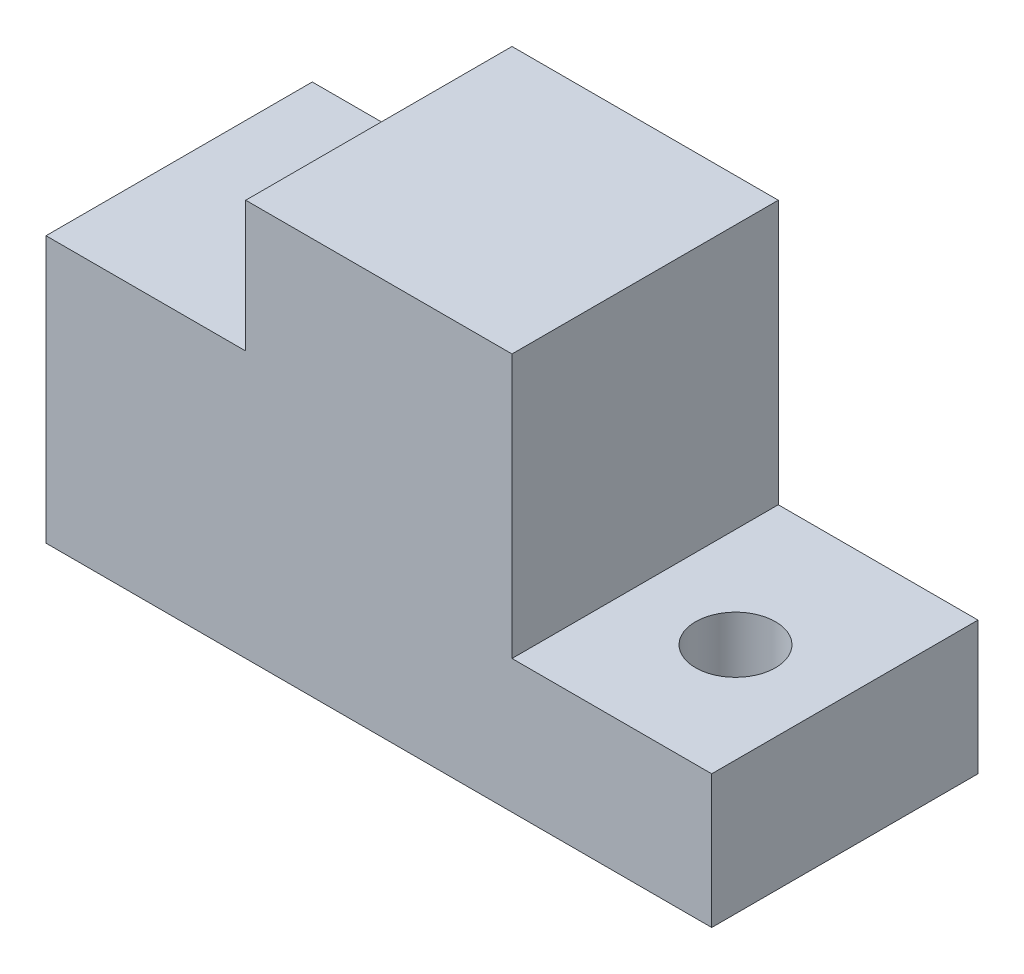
ISO-10303-21;
HEADER;
FILE_DESCRIPTION(('STEP AP214'),'2;1');
FILE_NAME('part.step','',(''),(''),'','','');
FILE_SCHEMA(('AUTOMOTIVE_DESIGN { 1 0 10303 214 1 1 1 1 }'));
ENDSEC;
DATA;
#1=APPLICATION_CONTEXT('core data for automotive mechanical design processes');
#2=APPLICATION_PROTOCOL_DEFINITION('international standard','automotive_design',2000,#1);
#3=PRODUCT_CONTEXT('',#1,'mechanical');
#4=PRODUCT('Part','Part','',(#3));
#5=PRODUCT_RELATED_PRODUCT_CATEGORY('part','',(#4));
#6=PRODUCT_DEFINITION_FORMATION('','',#4);
#7=PRODUCT_DEFINITION_CONTEXT('part definition',#1,'design');
#8=PRODUCT_DEFINITION('design','',#6,#7);
#9=PRODUCT_DEFINITION_SHAPE('','',#8);
#10=(LENGTH_UNIT() NAMED_UNIT(*) SI_UNIT(.MILLI.,.METRE.));
#11=(NAMED_UNIT(*) PLANE_ANGLE_UNIT() SI_UNIT($,.RADIAN.));
#12=(NAMED_UNIT(*) SI_UNIT($,.STERADIAN.) SOLID_ANGLE_UNIT());
#13=UNCERTAINTY_MEASURE_WITH_UNIT(LENGTH_MEASURE(1.E-05),#10,'distance_accuracy_value','');
#14=(GEOMETRIC_REPRESENTATION_CONTEXT(3) GLOBAL_UNCERTAINTY_ASSIGNED_CONTEXT((#13)) GLOBAL_UNIT_ASSIGNED_CONTEXT((#10,
#11,#12)) REPRESENTATION_CONTEXT('',''));
#15=CARTESIAN_POINT('',(0.,0.,0.));
#16=DIRECTION('',(0.,0.,1.));
#17=DIRECTION('',(1.,0.,0.));
#18=AXIS2_PLACEMENT_3D('',#15,#16,#17);
#19=CARTESIAN_POINT('',(0.,0.,20.));
#20=DIRECTION('',(0.,-1.,0.));
#21=DIRECTION('',(0.,0.,-1.));
#22=AXIS2_PLACEMENT_3D('',#19,#20,#21);
#23=PLANE('',#22);
#24=DIRECTION('',(-1.,0.,0.));
#25=VECTOR('',#24,1.);
#26=CARTESIAN_POINT('',(0.,0.,0.));
#27=LINE('',#26,#25);
#28=CARTESIAN_POINT('',(15.,0.,0.));
#29=VERTEX_POINT('',#28);
#30=CARTESIAN_POINT('',(0.,0.,0.));
#31=VERTEX_POINT('',#30);
#32=EDGE_CURVE('E146',#29,#31,#27,.T.);
#33=ORIENTED_EDGE('',*,*,#32,.T.);
#34=DIRECTION('',(0.,0.,-1.));
#35=VECTOR('',#34,1.);
#36=CARTESIAN_POINT('',(0.,0.,20.));
#37=LINE('',#36,#35);
#38=CARTESIAN_POINT('',(0.,0.,20.));
#39=VERTEX_POINT('',#38);
#40=EDGE_CURVE('E11',#39,#31,#37,.T.);
#41=ORIENTED_EDGE('',*,*,#40,.F.);
#42=DIRECTION('',(-1.,0.,0.));
#43=VECTOR('',#42,1.);
#44=CARTESIAN_POINT('',(0.,0.,20.));
#45=LINE('',#44,#43);
#46=CARTESIAN_POINT('',(15.,0.,20.));
#47=VERTEX_POINT('',#46);
#48=EDGE_CURVE('E169',#47,#39,#45,.T.);
#49=ORIENTED_EDGE('',*,*,#48,.F.);
#50=DIRECTION('',(0.,0.,-1.));
#51=VECTOR('',#50,1.);
#52=CARTESIAN_POINT('',(15.,0.,20.));
#53=LINE('',#52,#51);
#54=EDGE_CURVE('E142',#47,#29,#53,.T.);
#55=ORIENTED_EDGE('',*,*,#54,.T.);
#56=EDGE_LOOP('',(#33,#41,#49,#55));
#57=FACE_BOUND('',#56,.T.);
#58=ADVANCED_FACE('F45',(#57),#23,.F.);
#59=CARTESIAN_POINT('',(0.,0.,20.));
#60=DIRECTION('',(1.,0.,0.));
#61=DIRECTION('',(0.,1.,0.));
#62=AXIS2_PLACEMENT_3D('',#59,#60,#61);
#63=PLANE('',#62);
#64=DIRECTION('',(0.,-1.,0.));
#65=VECTOR('',#64,1.);
#66=CARTESIAN_POINT('',(0.,0.,0.));
#67=LINE('',#66,#65);
#68=CARTESIAN_POINT('',(0.,-20.,0.));
#69=VERTEX_POINT('',#68);
#70=EDGE_CURVE('E150',#31,#69,#67,.T.);
#71=ORIENTED_EDGE('',*,*,#70,.T.);
#72=DIRECTION('',(0.,0.,-1.));
#73=VECTOR('',#72,1.);
#74=CARTESIAN_POINT('',(0.,-20.,20.));
#75=LINE('',#74,#73);
#76=CARTESIAN_POINT('',(0.,-20.,20.));
#77=VERTEX_POINT('',#76);
#78=EDGE_CURVE('E54',#77,#69,#75,.T.);
#79=ORIENTED_EDGE('',*,*,#78,.F.);
#80=DIRECTION('',(0.,-1.,0.));
#81=VECTOR('',#80,1.);
#82=CARTESIAN_POINT('',(0.,0.,20.));
#83=LINE('',#82,#81);
#84=EDGE_CURVE('E105',#39,#77,#83,.T.);
#85=ORIENTED_EDGE('',*,*,#84,.F.);
#86=ORIENTED_EDGE('',*,*,#40,.T.);
#87=EDGE_LOOP('',(#71,#79,#85,#86));
#88=FACE_BOUND('',#87,.T.);
#89=ADVANCED_FACE('F233',(#88),#63,.F.);
#90=CARTESIAN_POINT('',(0.,-20.,20.));
#91=DIRECTION('',(0.,1.,0.));
#92=DIRECTION('',(0.,0.,1.));
#93=AXIS2_PLACEMENT_3D('',#90,#91,#92);
#94=PLANE('',#93);
#95=CARTESIAN_POINT('',(42.5,-20.,10.7120310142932));
#96=DIRECTION('',(0.,1.,0.));
#97=DIRECTION('',(0.,0.,1.));
#98=AXIS2_PLACEMENT_3D('',#95,#96,#97);
#99=CIRCLE('',#98,3.);
#100=CARTESIAN_POINT('',(42.5,-20.,13.7120310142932));
#101=VERTEX_POINT('',#100);
#102=EDGE_CURVE('E151',#101,#101,#99,.T.);
#103=ORIENTED_EDGE('',*,*,#102,.T.);
#104=EDGE_LOOP('',(#103));
#105=FACE_BOUND('',#104,.T.);
#106=DIRECTION('',(1.,0.,0.));
#107=VECTOR('',#106,1.);
#108=CARTESIAN_POINT('',(0.,-20.,0.));
#109=LINE('',#108,#107);
#110=CARTESIAN_POINT('',(50.,-20.,0.));
#111=VERTEX_POINT('',#110);
#112=EDGE_CURVE('E154',#69,#111,#109,.T.);
#113=ORIENTED_EDGE('',*,*,#112,.T.);
#114=DIRECTION('',(0.,0.,-1.));
#115=VECTOR('',#114,1.);
#116=CARTESIAN_POINT('',(50.,-20.,20.));
#117=LINE('',#116,#115);
#118=CARTESIAN_POINT('',(50.,-20.,20.));
#119=VERTEX_POINT('',#118);
#120=EDGE_CURVE('E180',#119,#111,#117,.T.);
#121=ORIENTED_EDGE('',*,*,#120,.F.);
#122=DIRECTION('',(1.,0.,0.));
#123=VECTOR('',#122,1.);
#124=CARTESIAN_POINT('',(0.,-20.,20.));
#125=LINE('',#124,#123);
#126=EDGE_CURVE('E190',#77,#119,#125,.T.);
#127=ORIENTED_EDGE('',*,*,#126,.F.);
#128=ORIENTED_EDGE('',*,*,#78,.T.);
#129=EDGE_LOOP('',(#113,#121,#127,#128));
#130=FACE_BOUND('',#129,.T.);
#131=ADVANCED_FACE('F188',(#105,#130),#94,.F.);
#132=CARTESIAN_POINT('',(50.,-20.,20.));
#133=DIRECTION('',(-1.,0.,0.));
#134=DIRECTION('',(0.,0.,1.));
#135=AXIS2_PLACEMENT_3D('',#132,#133,#134);
#136=PLANE('',#135);
#137=DIRECTION('',(0.,1.,0.));
#138=VECTOR('',#137,1.);
#139=CARTESIAN_POINT('',(50.,-20.,0.));
#140=LINE('',#139,#138);
#141=CARTESIAN_POINT('',(50.,-10.,0.));
#142=VERTEX_POINT('',#141);
#143=EDGE_CURVE('E157',#111,#142,#140,.T.);
#144=ORIENTED_EDGE('',*,*,#143,.T.);
#145=DIRECTION('',(0.,0.,-1.));
#146=VECTOR('',#145,1.);
#147=CARTESIAN_POINT('',(50.,-10.,20.));
#148=LINE('',#147,#146);
#149=CARTESIAN_POINT('',(50.,-10.,20.));
#150=VERTEX_POINT('',#149);
#151=EDGE_CURVE('E176',#150,#142,#148,.T.);
#152=ORIENTED_EDGE('',*,*,#151,.F.);
#153=DIRECTION('',(0.,1.,0.));
#154=VECTOR('',#153,1.);
#155=CARTESIAN_POINT('',(50.,-20.,20.));
#156=LINE('',#155,#154);
#157=EDGE_CURVE('E203',#119,#150,#156,.T.);
#158=ORIENTED_EDGE('',*,*,#157,.F.);
#159=ORIENTED_EDGE('',*,*,#120,.T.);
#160=EDGE_LOOP('',(#144,#152,#158,#159));
#161=FACE_BOUND('',#160,.T.);
#162=ADVANCED_FACE('F198',(#161),#136,.F.);
#163=CARTESIAN_POINT('',(50.,-10.,20.));
#164=DIRECTION('',(0.,-1.,0.));
#165=DIRECTION('',(1.,0.,0.));
#166=AXIS2_PLACEMENT_3D('',#163,#164,#165);
#167=PLANE('',#166);
#168=CARTESIAN_POINT('',(42.5,-10.,10.7120310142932));
#169=DIRECTION('',(0.,1.,0.));
#170=DIRECTION('',(-1.,0.,0.));
#171=AXIS2_PLACEMENT_3D('',#168,#169,#170);
#172=CIRCLE('',#171,3.);
#173=CARTESIAN_POINT('',(39.5,-10.,10.7120310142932));
#174=VERTEX_POINT('',#173);
#175=EDGE_CURVE('E216',#174,#174,#172,.T.);
#176=ORIENTED_EDGE('',*,*,#175,.F.);
#177=EDGE_LOOP('',(#176));
#178=FACE_BOUND('',#177,.T.);
#179=DIRECTION('',(-1.,0.,0.));
#180=VECTOR('',#179,1.);
#181=CARTESIAN_POINT('',(50.,-10.,0.));
#182=LINE('',#181,#180);
#183=CARTESIAN_POINT('',(35.,-10.,0.));
#184=VERTEX_POINT('',#183);
#185=EDGE_CURVE('E160',#142,#184,#182,.T.);
#186=ORIENTED_EDGE('',*,*,#185,.T.);
#187=DIRECTION('',(0.,0.,-1.));
#188=VECTOR('',#187,1.);
#189=CARTESIAN_POINT('',(35.,-10.,20.));
#190=LINE('',#189,#188);
#191=CARTESIAN_POINT('',(35.,-10.,20.));
#192=VERTEX_POINT('',#191);
#193=EDGE_CURVE('E135',#192,#184,#190,.T.);
#194=ORIENTED_EDGE('',*,*,#193,.F.);
#195=DIRECTION('',(-1.,0.,0.));
#196=VECTOR('',#195,1.);
#197=CARTESIAN_POINT('',(50.,-10.,20.));
#198=LINE('',#197,#196);
#199=EDGE_CURVE('E124',#150,#192,#198,.T.);
#200=ORIENTED_EDGE('',*,*,#199,.F.);
#201=ORIENTED_EDGE('',*,*,#151,.T.);
#202=EDGE_LOOP('',(#186,#194,#200,#201));
#203=FACE_BOUND('',#202,.T.);
#204=ADVANCED_FACE('F201',(#178,#203),#167,.F.);
#205=CARTESIAN_POINT('',(35.,9.80904750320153,20.));
#206=DIRECTION('',(-1.,0.,0.));
#207=DIRECTION('',(0.,0.,1.));
#208=AXIS2_PLACEMENT_3D('',#205,#206,#207);
#209=PLANE('',#208);
#210=DIRECTION('',(0.,1.,0.));
#211=VECTOR('',#210,1.);
#212=CARTESIAN_POINT('',(35.,9.80904750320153,0.));
#213=LINE('',#212,#211);
#214=CARTESIAN_POINT('',(35.,9.80904750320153,0.));
#215=VERTEX_POINT('',#214);
#216=EDGE_CURVE('E133',#184,#215,#213,.T.);
#217=ORIENTED_EDGE('',*,*,#216,.T.);
#218=DIRECTION('',(0.,0.,-1.));
#219=VECTOR('',#218,1.);
#220=CARTESIAN_POINT('',(35.,9.80904750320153,20.));
#221=LINE('',#220,#219);
#222=CARTESIAN_POINT('',(35.,9.80904750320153,20.));
#223=VERTEX_POINT('',#222);
#224=EDGE_CURVE('E130',#223,#215,#221,.T.);
#225=ORIENTED_EDGE('',*,*,#224,.F.);
#226=DIRECTION('',(0.,1.,0.));
#227=VECTOR('',#226,1.);
#228=CARTESIAN_POINT('',(35.,9.80904750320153,20.));
#229=LINE('',#228,#227);
#230=EDGE_CURVE('E118',#192,#223,#229,.T.);
#231=ORIENTED_EDGE('',*,*,#230,.F.);
#232=ORIENTED_EDGE('',*,*,#193,.T.);
#233=EDGE_LOOP('',(#217,#225,#231,#232));
#234=FACE_BOUND('',#233,.T.);
#235=ADVANCED_FACE('F131',(#234),#209,.F.);
#236=CARTESIAN_POINT('',(15.,9.80904750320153,20.));
#237=DIRECTION('',(0.,-1.,0.));
#238=DIRECTION('',(0.,0.,-1.));
#239=AXIS2_PLACEMENT_3D('',#236,#237,#238);
#240=PLANE('',#239);
#241=DIRECTION('',(-1.,0.,0.));
#242=VECTOR('',#241,1.);
#243=CARTESIAN_POINT('',(15.,9.80904750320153,0.));
#244=LINE('',#243,#242);
#245=CARTESIAN_POINT('',(15.,9.80904750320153,0.));
#246=VERTEX_POINT('',#245);
#247=EDGE_CURVE('E91',#215,#246,#244,.T.);
#248=ORIENTED_EDGE('',*,*,#247,.T.);
#249=DIRECTION('',(0.,0.,-1.));
#250=VECTOR('',#249,1.);
#251=CARTESIAN_POINT('',(15.,9.80904750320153,20.));
#252=LINE('',#251,#250);
#253=CARTESIAN_POINT('',(15.,9.80904750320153,20.));
#254=VERTEX_POINT('',#253);
#255=EDGE_CURVE('E136',#254,#246,#252,.T.);
#256=ORIENTED_EDGE('',*,*,#255,.F.);
#257=DIRECTION('',(-1.,0.,0.));
#258=VECTOR('',#257,1.);
#259=CARTESIAN_POINT('',(15.,9.80904750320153,20.));
#260=LINE('',#259,#258);
#261=EDGE_CURVE('E122',#223,#254,#260,.T.);
#262=ORIENTED_EDGE('',*,*,#261,.F.);
#263=ORIENTED_EDGE('',*,*,#224,.T.);
#264=EDGE_LOOP('',(#248,#256,#262,#263));
#265=FACE_BOUND('',#264,.T.);
#266=ADVANCED_FACE('F138',(#265),#240,.F.);
#267=CARTESIAN_POINT('',(15.,9.80904750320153,20.));
#268=DIRECTION('',(1.,0.,0.));
#269=DIRECTION('',(0.,0.,-1.));
#270=AXIS2_PLACEMENT_3D('',#267,#268,#269);
#271=PLANE('',#270);
#272=DIRECTION('',(0.,-1.,0.));
#273=VECTOR('',#272,1.);
#274=CARTESIAN_POINT('',(15.,9.80904750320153,0.));
#275=LINE('',#274,#273);
#276=EDGE_CURVE('E97',#246,#29,#275,.T.);
#277=ORIENTED_EDGE('',*,*,#276,.T.);
#278=ORIENTED_EDGE('',*,*,#54,.F.);
#279=DIRECTION('',(0.,-1.,0.));
#280=VECTOR('',#279,1.);
#281=CARTESIAN_POINT('',(15.,9.80904750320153,20.));
#282=LINE('',#281,#280);
#283=EDGE_CURVE('E62',#254,#47,#282,.T.);
#284=ORIENTED_EDGE('',*,*,#283,.F.);
#285=ORIENTED_EDGE('',*,*,#255,.T.);
#286=EDGE_LOOP('',(#277,#278,#284,#285));
#287=FACE_BOUND('',#286,.T.);
#288=ADVANCED_FACE('F240',(#287),#271,.F.);
#289=CARTESIAN_POINT('',(0.,0.,20.));
#290=DIRECTION('',(0.,0.,-1.));
#291=DIRECTION('',(-1.,0.,0.));
#292=AXIS2_PLACEMENT_3D('',#289,#290,#291);
#293=PLANE('',#292);
#294=ORIENTED_EDGE('',*,*,#48,.T.);
#295=ORIENTED_EDGE('',*,*,#84,.T.);
#296=ORIENTED_EDGE('',*,*,#126,.T.);
#297=ORIENTED_EDGE('',*,*,#157,.T.);
#298=ORIENTED_EDGE('',*,*,#199,.T.);
#299=ORIENTED_EDGE('',*,*,#230,.T.);
#300=ORIENTED_EDGE('',*,*,#261,.T.);
#301=ORIENTED_EDGE('',*,*,#283,.T.);
#302=EDGE_LOOP('',(#294,#295,#296,#297,#298,#299,#300,#301));
#303=FACE_BOUND('',#302,.T.);
#304=ADVANCED_FACE('F120',(#303),#293,.F.);
#305=CARTESIAN_POINT('',(0.,0.,0.));
#306=DIRECTION('',(0.,0.,-1.));
#307=DIRECTION('',(-1.,0.,0.));
#308=AXIS2_PLACEMENT_3D('',#305,#306,#307);
#309=PLANE('',#308);
#310=ORIENTED_EDGE('',*,*,#32,.F.);
#311=ORIENTED_EDGE('',*,*,#276,.F.);
#312=ORIENTED_EDGE('',*,*,#247,.F.);
#313=ORIENTED_EDGE('',*,*,#216,.F.);
#314=ORIENTED_EDGE('',*,*,#185,.F.);
#315=ORIENTED_EDGE('',*,*,#143,.F.);
#316=ORIENTED_EDGE('',*,*,#112,.F.);
#317=ORIENTED_EDGE('',*,*,#70,.F.);
#318=EDGE_LOOP('',(#310,#311,#312,#313,#314,#315,#316,#317));
#319=FACE_BOUND('',#318,.T.);
#320=ADVANCED_FACE('F194',(#319),#309,.T.);
#321=CARTESIAN_POINT('',(42.5,-30.,10.7120310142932));
#322=DIRECTION('',(0.,1.,0.));
#323=DIRECTION('',(-1.,0.,0.));
#324=AXIS2_PLACEMENT_3D('',#321,#322,#323);
#325=CYLINDRICAL_SURFACE('',#324,3.);
#326=ORIENTED_EDGE('',*,*,#175,.T.);
#327=EDGE_LOOP('',(#326));
#328=FACE_BOUND('',#327,.T.);
#329=ORIENTED_EDGE('',*,*,#102,.F.);
#330=EDGE_LOOP('',(#329));
#331=FACE_BOUND('',#330,.T.);
#332=ADVANCED_FACE('F221',(#328,#331),#325,.F.);
#333=CLOSED_SHELL('',(#58,#89,#131,#162,#204,#235,#266,#288,#304,#320,#332));
#334=MANIFOLD_SOLID_BREP('B2',#333);
#335=ADVANCED_BREP_SHAPE_REPRESENTATION('',(#18,#334),#14);
#336=SHAPE_DEFINITION_REPRESENTATION(#9,#335);
ENDSEC;
END-ISO-10303-21;
